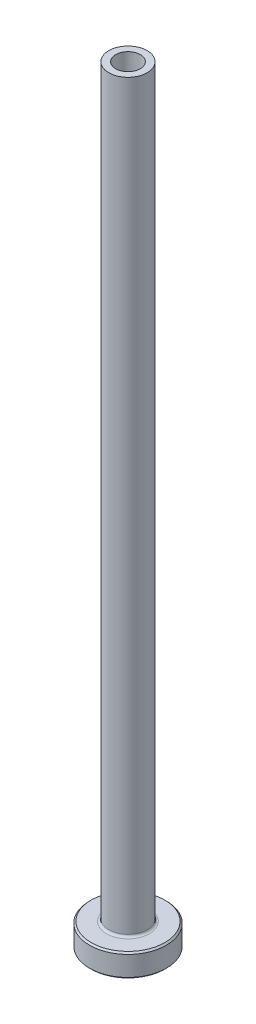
from build123d import *

# Parameters (mm, degrees)
FILLET1_R     = 0.3
CHAMFER1_SIZE = 0.2
CHAMFER3_SIZE = 0.5


with BuildPart() as part:
    # Sketch1 → Revolve1 (revolve)
    with BuildSketch(Plane.XY, mode=Mode.PRIVATE) as revolve1_sk:
        Polygon((-1.6, 100), (-2.5, 100), (-2.5, 3), (-5, 3), (-5, 0), (-1.85, 0), (-1.85, 43), (-1.6, 55), align=None)
    revolve(revolve1_sk.sketch.rotate(Axis((0, 92.187680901, 0), (0, -1, 0)), 270), axis=Axis((0, 92.187680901, 0), (0, -1, 0)))

    # Fillet1
    fillet1_edges = [part.edges().sort_by_distance(p)[0] for p in [
        (0, 3, -2.5),
    ]]
    fillet(fillet1_edges, radius=FILLET1_R)

    # Chamfer1
    chamfer1_edges = [part.edges().sort_by_distance(p)[0] for p in [
        (0, 0, -5),
        (0, 3, -5),
    ]]
    chamfer(chamfer1_edges, length=CHAMFER1_SIZE)

    # Chamfer3
    chamfer3_edges = [part.edges().sort_by_distance(p)[0] for p in [
        (0, 0, -1.85),
    ]]
    chamfer(chamfer3_edges, length=CHAMFER3_SIZE)


solid = part.part
